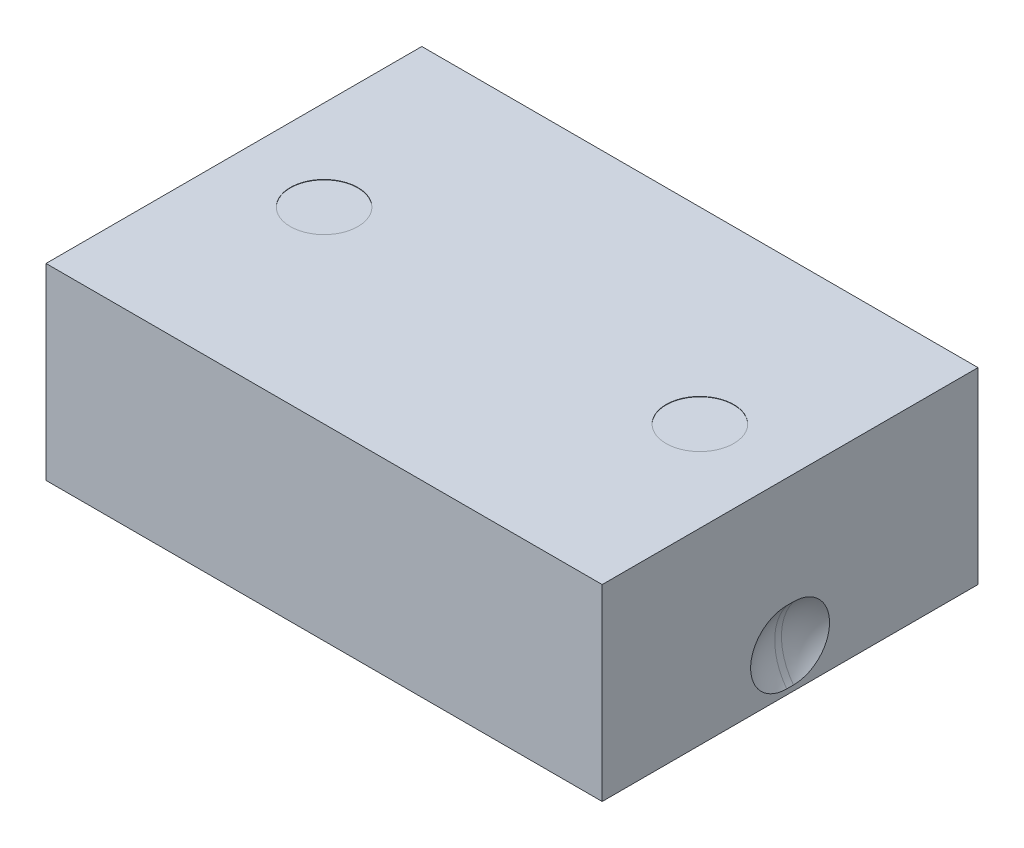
ISO-10303-21;
HEADER;
FILE_DESCRIPTION(('STEP AP214'),'2;1');
FILE_NAME('part.step','',(''),(''),'','','');
FILE_SCHEMA(('AUTOMOTIVE_DESIGN { 1 0 10303 214 1 1 1 1 }'));
ENDSEC;
DATA;
#1=APPLICATION_CONTEXT('core data for automotive mechanical design processes');
#2=APPLICATION_PROTOCOL_DEFINITION('international standard','automotive_design',2000,#1);
#3=PRODUCT_CONTEXT('',#1,'mechanical');
#4=PRODUCT('Part','Part','',(#3));
#5=PRODUCT_RELATED_PRODUCT_CATEGORY('part','',(#4));
#6=PRODUCT_DEFINITION_FORMATION('','',#4);
#7=PRODUCT_DEFINITION_CONTEXT('part definition',#1,'design');
#8=PRODUCT_DEFINITION('design','',#6,#7);
#9=PRODUCT_DEFINITION_SHAPE('','',#8);
#10=(LENGTH_UNIT() NAMED_UNIT(*) SI_UNIT(.MILLI.,.METRE.));
#11=(NAMED_UNIT(*) PLANE_ANGLE_UNIT() SI_UNIT($,.RADIAN.));
#12=(NAMED_UNIT(*) SI_UNIT($,.STERADIAN.) SOLID_ANGLE_UNIT());
#13=UNCERTAINTY_MEASURE_WITH_UNIT(LENGTH_MEASURE(1.E-05),#10,'distance_accuracy_value','');
#14=(GEOMETRIC_REPRESENTATION_CONTEXT(3) GLOBAL_UNCERTAINTY_ASSIGNED_CONTEXT((#13)) GLOBAL_UNIT_ASSIGNED_CONTEXT((#10,
#11,#12)) REPRESENTATION_CONTEXT('',''));
#15=CARTESIAN_POINT('',(0.,0.,0.));
#16=DIRECTION('',(0.,0.,1.));
#17=DIRECTION('',(1.,0.,0.));
#18=AXIS2_PLACEMENT_3D('',#15,#16,#17);
#19=CARTESIAN_POINT('',(50.,120.,0.));
#20=DIRECTION('',(0.,1.,0.));
#21=DIRECTION('',(0.,0.,1.));
#22=AXIS2_PLACEMENT_3D('',#19,#20,#21);
#23=PLANE('',#22);
#24=CARTESIAN_POINT('',(-50.,120.,0.));
#25=DIRECTION('',(0.,1.,0.));
#26=DIRECTION('',(0.,0.,1.));
#27=AXIS2_PLACEMENT_3D('',#24,#25,#26);
#28=CIRCLE('',#27,9.);
#29=CARTESIAN_POINT('',(-50.,120.,9.));
#30=VERTEX_POINT('',#29);
#31=EDGE_CURVE('E326',#30,#30,#28,.T.);
#32=ORIENTED_EDGE('',*,*,#31,.F.);
#33=EDGE_LOOP('',(#32));
#34=FACE_BOUND('',#33,.T.);
#35=CARTESIAN_POINT('',(50.,120.,0.));
#36=DIRECTION('',(0.,1.,0.));
#37=DIRECTION('',(0.,0.,1.));
#38=AXIS2_PLACEMENT_3D('',#35,#36,#37);
#39=CIRCLE('',#38,9.);
#40=CARTESIAN_POINT('',(50.,120.,9.));
#41=VERTEX_POINT('',#40);
#42=EDGE_CURVE('E318',#41,#41,#39,.T.);
#43=ORIENTED_EDGE('',*,*,#42,.F.);
#44=EDGE_LOOP('',(#43));
#45=FACE_BOUND('',#44,.T.);
#46=DIRECTION('',(0.,0.,-1.));
#47=VECTOR('',#46,1.);
#48=CARTESIAN_POINT('',(74.,120.,-50.));
#49=LINE('',#48,#47);
#50=CARTESIAN_POINT('',(74.,120.,-50.));
#51=VERTEX_POINT('',#50);
#52=CARTESIAN_POINT('',(74.,120.,50.));
#53=VERTEX_POINT('',#52);
#54=EDGE_CURVE('E92',#51,#53,#49,.F.);
#55=ORIENTED_EDGE('',*,*,#54,.F.);
#56=DIRECTION('',(-1.,0.,0.));
#57=VECTOR('',#56,1.);
#58=CARTESIAN_POINT('',(-74.,120.,-50.));
#59=LINE('',#58,#57);
#60=CARTESIAN_POINT('',(-74.,120.,-50.));
#61=VERTEX_POINT('',#60);
#62=EDGE_CURVE('E102',#61,#51,#59,.F.);
#63=ORIENTED_EDGE('',*,*,#62,.F.);
#64=DIRECTION('',(0.,0.,1.));
#65=VECTOR('',#64,1.);
#66=CARTESIAN_POINT('',(-74.,120.,50.));
#67=LINE('',#66,#65);
#68=CARTESIAN_POINT('',(-74.,120.,50.));
#69=VERTEX_POINT('',#68);
#70=EDGE_CURVE('E108',#69,#61,#67,.F.);
#71=ORIENTED_EDGE('',*,*,#70,.F.);
#72=DIRECTION('',(1.,0.,0.));
#73=VECTOR('',#72,1.);
#74=CARTESIAN_POINT('',(74.,120.,50.));
#75=LINE('',#74,#73);
#76=EDGE_CURVE('E107',#53,#69,#75,.F.);
#77=ORIENTED_EDGE('',*,*,#76,.F.);
#78=EDGE_LOOP('',(#55,#63,#71,#77));
#79=FACE_BOUND('',#78,.T.);
#80=ADVANCED_FACE('F14',(#34,#45,#79),#23,.T.);
#81=CARTESIAN_POINT('',(50.,115.,0.));
#82=DIRECTION('',(0.,1.,0.));
#83=DIRECTION('',(0.,0.,1.));
#84=AXIS2_PLACEMENT_3D('',#81,#82,#83);
#85=PLANE('',#84);
#86=CARTESIAN_POINT('',(50.,115.,0.));
#87=DIRECTION('',(0.,-1.,0.));
#88=DIRECTION('',(0.,0.,-1.));
#89=AXIS2_PLACEMENT_3D('',#86,#87,#88);
#90=CIRCLE('',#89,9.);
#91=CARTESIAN_POINT('',(50.,115.,-9.));
#92=VERTEX_POINT('',#91);
#93=EDGE_CURVE('E9',#92,#92,#90,.F.);
#94=ORIENTED_EDGE('',*,*,#93,.F.);
#95=EDGE_LOOP('',(#94));
#96=FACE_BOUND('',#95,.T.);
#97=ADVANCED_FACE('F175',(#96),#85,.F.);
#98=CARTESIAN_POINT('',(-50.,115.,0.));
#99=DIRECTION('',(0.,1.,0.));
#100=DIRECTION('',(0.,0.,1.));
#101=AXIS2_PLACEMENT_3D('',#98,#99,#100);
#102=PLANE('',#101);
#103=CARTESIAN_POINT('',(-50.,115.,0.));
#104=DIRECTION('',(0.,1.,0.));
#105=DIRECTION('',(0.,0.,1.));
#106=AXIS2_PLACEMENT_3D('',#103,#104,#105);
#107=CIRCLE('',#106,9.);
#108=CARTESIAN_POINT('',(-50.,115.,9.));
#109=VERTEX_POINT('',#108);
#110=EDGE_CURVE('E23',#109,#109,#107,.T.);
#111=ORIENTED_EDGE('',*,*,#110,.F.);
#112=EDGE_LOOP('',(#111));
#113=FACE_BOUND('',#112,.T.);
#114=ADVANCED_FACE('F172',(#113),#102,.F.);
#115=CARTESIAN_POINT('',(-50.,97.5,0.));
#116=DIRECTION('',(0.,1.,0.));
#117=DIRECTION('',(0.,0.,1.));
#118=AXIS2_PLACEMENT_3D('',#115,#116,#117);
#119=CYLINDRICAL_SURFACE('',#118,9.);
#120=ORIENTED_EDGE('',*,*,#110,.T.);
#121=EDGE_LOOP('',(#120));
#122=FACE_BOUND('',#121,.T.);
#123=CARTESIAN_POINT('',(-50.,80.,0.));
#124=DIRECTION('',(0.,1.,0.));
#125=DIRECTION('',(0.,0.,1.));
#126=AXIS2_PLACEMENT_3D('',#123,#124,#125);
#127=CIRCLE('',#126,9.);
#128=CARTESIAN_POINT('',(-50.,80.,9.));
#129=VERTEX_POINT('',#128);
#130=EDGE_CURVE('E17',#129,#129,#127,.F.);
#131=ORIENTED_EDGE('',*,*,#130,.T.);
#132=EDGE_LOOP('',(#131));
#133=FACE_BOUND('',#132,.T.);
#134=ADVANCED_FACE('F174',(#122,#133),#119,.F.);
#135=CARTESIAN_POINT('',(-57.125,80.,0.));
#136=DIRECTION('',(0.,-1.,0.));
#137=DIRECTION('',(0.,0.,-1.));
#138=AXIS2_PLACEMENT_3D('',#135,#136,#137);
#139=PLANE('',#138);
#140=CARTESIAN_POINT('',(-50.,80.,0.));
#141=DIRECTION('',(0.,1.,0.));
#142=DIRECTION('',(0.,0.,1.));
#143=AXIS2_PLACEMENT_3D('',#140,#141,#142);
#144=CIRCLE('',#143,5.25);
#145=CARTESIAN_POINT('',(-50.,80.,5.25));
#146=VERTEX_POINT('',#145);
#147=EDGE_CURVE('E310',#146,#146,#144,.F.);
#148=ORIENTED_EDGE('',*,*,#147,.T.);
#149=EDGE_LOOP('',(#148));
#150=FACE_BOUND('',#149,.T.);
#151=ORIENTED_EDGE('',*,*,#130,.F.);
#152=EDGE_LOOP('',(#151));
#153=FACE_BOUND('',#152,.T.);
#154=ADVANCED_FACE('F193',(#150,#153),#139,.F.);
#155=CARTESIAN_POINT('',(-50.,72.1,0.));
#156=DIRECTION('',(0.,1.,0.));
#157=DIRECTION('',(0.,0.,1.));
#158=AXIS2_PLACEMENT_3D('',#155,#156,#157);
#159=CYLINDRICAL_SURFACE('',#158,5.25);
#160=ORIENTED_EDGE('',*,*,#147,.F.);
#161=EDGE_LOOP('',(#160));
#162=FACE_BOUND('',#161,.T.);
#163=CARTESIAN_POINT('',(-50.,64.3,0.));
#164=DIRECTION('',(0.,1.,0.));
#165=DIRECTION('',(0.,0.,1.));
#166=AXIS2_PLACEMENT_3D('',#163,#164,#165);
#167=CIRCLE('',#166,5.25);
#168=CARTESIAN_POINT('',(-50.,64.3,5.25));
#169=VERTEX_POINT('',#168);
#170=EDGE_CURVE('E304',#169,#169,#167,.T.);
#171=ORIENTED_EDGE('',*,*,#170,.F.);
#172=EDGE_LOOP('',(#171));
#173=FACE_BOUND('',#172,.T.);
#174=ADVANCED_FACE('F200',(#162,#173),#159,.F.);
#175=CARTESIAN_POINT('',(-54.5,64.3,0.));
#176=DIRECTION('',(0.,-1.,0.));
#177=DIRECTION('',(0.,0.,-1.));
#178=AXIS2_PLACEMENT_3D('',#175,#176,#177);
#179=PLANE('',#178);
#180=CARTESIAN_POINT('',(-50.,64.3,0.));
#181=DIRECTION('',(0.,1.,0.));
#182=DIRECTION('',(0.,0.,1.));
#183=AXIS2_PLACEMENT_3D('',#180,#181,#182);
#184=CIRCLE('',#183,9.);
#185=CARTESIAN_POINT('',(-50.,64.3,9.));
#186=VERTEX_POINT('',#185);
#187=EDGE_CURVE('E292',#186,#186,#184,.T.);
#188=ORIENTED_EDGE('',*,*,#187,.F.);
#189=EDGE_LOOP('',(#188));
#190=FACE_BOUND('',#189,.T.);
#191=ORIENTED_EDGE('',*,*,#170,.T.);
#192=EDGE_LOOP('',(#191));
#193=FACE_BOUND('',#192,.T.);
#194=ADVANCED_FACE('F221',(#190,#193),#179,.T.);
#195=CARTESIAN_POINT('',(-50.,67.15,0.));
#196=DIRECTION('',(0.,1.,0.));
#197=DIRECTION('',(0.,0.,1.));
#198=AXIS2_PLACEMENT_3D('',#195,#196,#197);
#199=CYLINDRICAL_SURFACE('',#198,9.);
#200=ORIENTED_EDGE('',*,*,#187,.T.);
#201=EDGE_LOOP('',(#200));
#202=FACE_BOUND('',#201,.T.);
#203=CARTESIAN_POINT('',(-50.,70.,0.));
#204=DIRECTION('',(0.,1.,0.));
#205=DIRECTION('',(0.,0.,1.));
#206=AXIS2_PLACEMENT_3D('',#203,#204,#205);
#207=CIRCLE('',#206,9.);
#208=CARTESIAN_POINT('',(-50.,70.,9.));
#209=VERTEX_POINT('',#208);
#210=EDGE_CURVE('E120',#209,#209,#207,.F.);
#211=ORIENTED_EDGE('',*,*,#210,.T.);
#212=EDGE_LOOP('',(#211));
#213=FACE_BOUND('',#212,.T.);
#214=ADVANCED_FACE('F229',(#202,#213),#199,.T.);
#215=CARTESIAN_POINT('',(50.,67.15,0.));
#216=DIRECTION('',(0.,-1.,0.));
#217=DIRECTION('',(0.,0.,-1.));
#218=AXIS2_PLACEMENT_3D('',#215,#216,#217);
#219=CYLINDRICAL_SURFACE('',#218,9.);
#220=CARTESIAN_POINT('',(50.,64.3,0.));
#221=DIRECTION('',(0.,-1.,0.));
#222=DIRECTION('',(0.,0.,-1.));
#223=AXIS2_PLACEMENT_3D('',#220,#221,#222);
#224=CIRCLE('',#223,9.);
#225=CARTESIAN_POINT('',(50.,64.3,-9.));
#226=VERTEX_POINT('',#225);
#227=EDGE_CURVE('E98',#226,#226,#224,.F.);
#228=ORIENTED_EDGE('',*,*,#227,.T.);
#229=EDGE_LOOP('',(#228));
#230=FACE_BOUND('',#229,.T.);
#231=CARTESIAN_POINT('',(50.,70.,0.));
#232=DIRECTION('',(0.,-1.,0.));
#233=DIRECTION('',(0.,0.,-1.));
#234=AXIS2_PLACEMENT_3D('',#231,#232,#233);
#235=CIRCLE('',#234,9.);
#236=CARTESIAN_POINT('',(50.,70.,-9.));
#237=VERTEX_POINT('',#236);
#238=EDGE_CURVE('E134',#237,#237,#235,.T.);
#239=ORIENTED_EDGE('',*,*,#238,.T.);
#240=EDGE_LOOP('',(#239));
#241=FACE_BOUND('',#240,.T.);
#242=ADVANCED_FACE('F267',(#230,#241),#219,.T.);
#243=CARTESIAN_POINT('',(-86.8,81.,-0.900000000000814));
#244=DIRECTION('',(0.411996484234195,0.570250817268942,0.710684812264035));
#245=DIRECTION('',(-0.809037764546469,0.587750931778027,-0.00259571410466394));
#246=AXIS2_PLACEMENT_3D('',#243,#244,#245);
#247=SPHERICAL_SURFACE('',#246,16.);
#248=CARTESIAN_POINT('',(-86.8,81.,-0.9));
#249=DIRECTION('',(0.,0.,1.));
#250=DIRECTION('',(1.,0.,0.));
#251=AXIS2_PLACEMENT_3D('',#248,#249,#250);
#252=CIRCLE('',#251,16.);
#253=CARTESIAN_POINT('',(-74.,71.4,-0.9));
#254=VERTEX_POINT('',#253);
#255=CARTESIAN_POINT('',(-74.,90.6,-0.9));
#256=VERTEX_POINT('',#255);
#257=EDGE_CURVE('E293',#254,#256,#252,.T.);
#258=ORIENTED_EDGE('',*,*,#257,.T.);
#259=CARTESIAN_POINT('',(-74.,71.3999999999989,-0.9));
#260=CARTESIAN_POINT('',(-74.,71.3999709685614,-1.17000302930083));
#261=CARTESIAN_POINT('',(-74.,71.411389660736,-1.44000188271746));
#262=CARTESIAN_POINT('',(-74.,71.4569128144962,-1.97806793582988));
#263=CARTESIAN_POINT('',(-74.,71.4910161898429,-2.24613522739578));
#264=CARTESIAN_POINT('',(-74.,71.5816671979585,-2.77825399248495));
#265=CARTESIAN_POINT('',(-74.,71.6381990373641,-3.04230815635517));
#266=CARTESIAN_POINT('',(-74.,71.7732956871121,-3.56471500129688));
#267=CARTESIAN_POINT('',(-74.,71.8518602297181,-3.82306775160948));
#268=CARTESIAN_POINT('',(-74.,72.0305080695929,-4.33235682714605));
#269=CARTESIAN_POINT('',(-74.,72.1306012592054,-4.5832896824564));
#270=CARTESIAN_POINT('',(-74.,72.3515750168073,-5.07583571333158));
#271=CARTESIAN_POINT('',(-74.,72.4724560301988,-5.31744868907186));
#272=CARTESIAN_POINT('',(-74.,72.7341176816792,-5.7895827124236));
#273=CARTESIAN_POINT('',(-74.,72.8748942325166,-6.02010602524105));
#274=CARTESIAN_POINT('',(-74.,73.1753642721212,-6.46847415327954));
#275=CARTESIAN_POINT('',(-74.,73.3350576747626,-6.68631902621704));
#276=CARTESIAN_POINT('',(-74.,73.6722327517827,-7.10779034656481));
#277=CARTESIAN_POINT('',(-74.,73.8497150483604,-7.31141629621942));
#278=CARTESIAN_POINT('',(-74.,74.2211976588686,-7.70298975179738));
#279=CARTESIAN_POINT('',(-74.,74.4151976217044,-7.89093759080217));
#280=CARTESIAN_POINT('',(-74.,74.8183728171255,-8.24985305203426));
#281=CARTESIAN_POINT('',(-74.,75.0275505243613,-8.42081789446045));
#282=CARTESIAN_POINT('',(-74.,75.45956572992,-8.74451672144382));
#283=CARTESIAN_POINT('',(-74.,75.682403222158,-8.89725071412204));
#284=CARTESIAN_POINT('',(-74.,76.1401435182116,-9.18339562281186));
#285=CARTESIAN_POINT('',(-74.,76.3750457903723,-9.31680738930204));
#286=CARTESIAN_POINT('',(-74.,76.8552545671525,-9.56336732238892));
#287=CARTESIAN_POINT('',(-74.,77.1005610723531,-9.67651548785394));
#288=CARTESIAN_POINT('',(-74.,77.5998181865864,-9.88173715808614));
#289=CARTESIAN_POINT('',(-74.,77.853768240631,-9.97381201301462));
#290=CARTESIAN_POINT('',(-74.,78.3685220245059,-10.1362417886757));
#291=CARTESIAN_POINT('',(-74.,78.6293257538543,-10.2065967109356));
#292=CARTESIAN_POINT('',(-74.,79.1559382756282,-10.3250876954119));
#293=CARTESIAN_POINT('',(-74.,79.421747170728,-10.3732233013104));
#294=CARTESIAN_POINT('',(-74.,79.9564751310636,-10.446931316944));
#295=CARTESIAN_POINT('',(-74.,80.2253941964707,-10.4725037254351));
#296=CARTESIAN_POINT('',(-74.,80.7644368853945,-10.5009038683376));
#297=CARTESIAN_POINT('',(-74.,81.0345605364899,-10.5037310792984));
#298=CARTESIAN_POINT('',(-74.,81.57408578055,-10.4866193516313));
#299=CARTESIAN_POINT('',(-74.,81.843487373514,-10.4666804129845));
#300=CARTESIAN_POINT('',(-74.,82.3796505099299,-10.4041784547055));
#301=CARTESIAN_POINT('',(-74.,82.6464120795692,-10.3616156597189));
#302=CARTESIAN_POINT('',(-74.,83.1754013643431,-10.254168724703));
#303=CARTESIAN_POINT('',(-74.,83.4376290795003,-10.1892845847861));
#304=CARTESIAN_POINT('',(-74.,83.9556855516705,-10.0376564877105));
#305=CARTESIAN_POINT('',(-74.,84.2115143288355,-9.95091259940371));
#306=CARTESIAN_POINT('',(-74.,84.7149549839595,-9.75618160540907));
#307=CARTESIAN_POINT('',(-74.,84.9625668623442,-9.64819450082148));
#308=CARTESIAN_POINT('',(-74.,85.4478197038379,-9.41174170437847));
#309=CARTESIAN_POINT('',(-74.,85.6854604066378,-9.28327547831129));
#310=CARTESIAN_POINT('',(-74.,86.1490745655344,-9.0067797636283));
#311=CARTESIAN_POINT('',(-74.,86.3750480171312,-8.85875026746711));
#312=CARTESIAN_POINT('',(-74.,86.8137102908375,-8.5441881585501));
#313=CARTESIAN_POINT('',(-74.,87.0263997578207,-8.37765644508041));
#314=CARTESIAN_POINT('',(-74.,87.4369936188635,-8.02726825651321));
#315=CARTESIAN_POINT('',(-74.,87.6348980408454,-7.84341181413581));
#316=CARTESIAN_POINT('',(-74.,88.0144879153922,-7.45970867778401));
#317=CARTESIAN_POINT('',(-74.,88.1961757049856,-7.25986429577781));
#318=CARTESIAN_POINT('',(-74.,88.5420768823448,-6.84557802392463));
#319=CARTESIAN_POINT('',(-74.,88.7062898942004,-6.63113582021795));
#320=CARTESIAN_POINT('',(-74.,89.0161199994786,-6.18911041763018));
#321=CARTESIAN_POINT('',(-74.,89.1617310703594,-5.96152299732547));
#322=CARTESIAN_POINT('',(-74.,89.4332554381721,-5.49489573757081));
#323=CARTESIAN_POINT('',(-74.,89.5591693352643,-5.25585624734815));
#324=CARTESIAN_POINT('',(-74.,89.7904830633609,-4.76786320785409));
#325=CARTESIAN_POINT('',(-74.,89.8958697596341,-4.51890343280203));
#326=CARTESIAN_POINT('',(-74.,90.0852761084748,-4.01299030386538));
#327=CARTESIAN_POINT('',(-74.,90.1692963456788,-3.75603716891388));
#328=CARTESIAN_POINT('',(-74.,90.315281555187,-3.23630141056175));
#329=CARTESIAN_POINT('',(-74.,90.377274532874,-2.97352664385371));
#330=CARTESIAN_POINT('',(-74.,90.4788912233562,-2.44379460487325));
#331=CARTESIAN_POINT('',(-74.,90.518525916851,-2.17683945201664));
#332=CARTESIAN_POINT('',(-74.,90.5645706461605,-1.74108609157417));
#333=CARTESIAN_POINT('',(-74.,90.5778651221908,-1.57298540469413));
#334=CARTESIAN_POINT('',(-74.,90.59557343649,-1.236595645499));
#335=CARTESIAN_POINT('',(-74.,90.6000019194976,-1.06830734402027));
#336=CARTESIAN_POINT('',(-74.,90.6000000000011,-0.9));
#337=B_SPLINE_CURVE_WITH_KNOTS('',3,(#259,#260,#261,#262,#263,#264,#265,#266,#267,#268,#269,
#270,#271,#272,#273,#274,#275,#276,#277,#278,#279,#280,#281,#282,#283,#284,#285,#286,#287,#288,
#289,#290,#291,#292,#293,#294,#295,#296,#297,#298,#299,#300,#301,#302,#303,#304,#305,#306,#307,
#308,#309,#310,#311,#312,#313,#314,#315,#316,#317,#318,#319,#320,#321,#322,#323,#324,#325,#326,
#327,#328,#329,#330,#331,#332,#333,#334,#335,#336),.UNSPECIFIED.,.F.,.F.,(4,2,2,2,2,2,2,2,2,2,2,
2,2,2,2,2,2,2,2,2,2,2,2,2,2,2,2,2,2,2,2,2,2,2,2,2,2,2,4),(0.,0.809761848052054,1.61948492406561,
2.42863882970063,3.23778290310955,4.04729957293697,4.85683358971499,5.66620154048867,
6.47556580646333,7.2849583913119,8.09433377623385,8.90384142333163,9.7133487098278,
10.5228203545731,11.3322920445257,12.1417118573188,12.9511316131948,13.760567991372,
14.5700044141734,15.3794594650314,16.1889145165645,16.998361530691,17.8078085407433,
18.6172530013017,19.4266974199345,20.2361629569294,21.0456288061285,21.8550553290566,
22.6644803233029,23.4737884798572,24.2831140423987,25.0927009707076,25.9022632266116,
26.7123418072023,27.522398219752,28.3314210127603,29.1400461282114,29.6457079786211,
30.1505338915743),.UNSPECIFIED.);
#338=EDGE_CURVE('E114',#254,#256,#337,.T.);
#339=ORIENTED_EDGE('',*,*,#338,.F.);
#340=EDGE_LOOP('',(#258,#339));
#341=FACE_BOUND('',#340,.T.);
#342=ADVANCED_FACE('F252',(#341),#247,.F.);
#343=CARTESIAN_POINT('',(-86.8,81.,0.900000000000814));
#344=DIRECTION('',(0.411996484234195,0.570250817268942,0.710684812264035));
#345=DIRECTION('',(-0.809037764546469,0.587750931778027,-0.00259571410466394));
#346=AXIS2_PLACEMENT_3D('',#343,#344,#345);
#347=SPHERICAL_SURFACE('',#346,16.);
#348=CARTESIAN_POINT('',(-86.8,81.,0.9));
#349=DIRECTION('',(0.,0.,1.));
#350=DIRECTION('',(1.,0.,0.));
#351=AXIS2_PLACEMENT_3D('',#348,#349,#350);
#352=CIRCLE('',#351,16.);
#353=CARTESIAN_POINT('',(-74.,71.4,0.9));
#354=VERTEX_POINT('',#353);
#355=CARTESIAN_POINT('',(-74.,90.6,0.9));
#356=VERTEX_POINT('',#355);
#357=EDGE_CURVE('E289',#354,#356,#352,.T.);
#358=ORIENTED_EDGE('',*,*,#357,.F.);
#359=CARTESIAN_POINT('',(-74.,90.6000000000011,0.9));
#360=CARTESIAN_POINT('',(-74.,90.6000290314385,1.17000302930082));
#361=CARTESIAN_POINT('',(-74.,90.5886103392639,1.44000188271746));
#362=CARTESIAN_POINT('',(-74.,90.5430871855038,1.97806793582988));
#363=CARTESIAN_POINT('',(-74.,90.5089838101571,2.24613522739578));
#364=CARTESIAN_POINT('',(-74.,90.4183328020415,2.77825399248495));
#365=CARTESIAN_POINT('',(-74.,90.3618009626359,3.04230815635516));
#366=CARTESIAN_POINT('',(-74.,90.226704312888,3.56471500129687));
#367=CARTESIAN_POINT('',(-74.,90.148139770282,3.82306775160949));
#368=CARTESIAN_POINT('',(-74.,89.9694919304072,4.33235682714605));
#369=CARTESIAN_POINT('',(-74.,89.8693987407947,4.58328968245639));
#370=CARTESIAN_POINT('',(-74.,89.6484249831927,5.07583571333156));
#371=CARTESIAN_POINT('',(-74.,89.5275439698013,5.31744868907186));
#372=CARTESIAN_POINT('',(-74.,89.2658823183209,5.78958271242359));
#373=CARTESIAN_POINT('',(-74.,89.1251057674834,6.02010602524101));
#374=CARTESIAN_POINT('',(-74.,88.8246357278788,6.4684741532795));
#375=CARTESIAN_POINT('',(-74.,88.6649423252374,6.68631902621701));
#376=CARTESIAN_POINT('',(-74.,88.3277672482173,7.1077903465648));
#377=CARTESIAN_POINT('',(-74.,88.1502849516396,7.3114162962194));
#378=CARTESIAN_POINT('',(-74.,87.7788023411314,7.70298975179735));
#379=CARTESIAN_POINT('',(-74.,87.5848023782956,7.89093759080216));
#380=CARTESIAN_POINT('',(-74.,87.1816271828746,8.24985305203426));
#381=CARTESIAN_POINT('',(-74.,86.9724494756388,8.42081789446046));
#382=CARTESIAN_POINT('',(-74.,86.54043427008,8.74451672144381));
#383=CARTESIAN_POINT('',(-74.,86.317596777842,8.89725071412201));
#384=CARTESIAN_POINT('',(-74.,85.8598564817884,9.18339562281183));
#385=CARTESIAN_POINT('',(-74.,85.6249542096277,9.31680738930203));
#386=CARTESIAN_POINT('',(-74.,85.1447454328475,9.56336732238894));
#387=CARTESIAN_POINT('',(-74.,84.8994389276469,9.67651548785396));
#388=CARTESIAN_POINT('',(-74.,84.4001818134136,9.88173715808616));
#389=CARTESIAN_POINT('',(-74.,84.146231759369,9.97381201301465));
#390=CARTESIAN_POINT('',(-74.,83.6314779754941,10.1362417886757));
#391=CARTESIAN_POINT('',(-74.,83.3706742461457,10.2065967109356));
#392=CARTESIAN_POINT('',(-74.,82.8440617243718,10.3250876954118));
#393=CARTESIAN_POINT('',(-74.,82.5782528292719,10.3732233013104));
#394=CARTESIAN_POINT('',(-74.,82.0435248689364,10.446931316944));
#395=CARTESIAN_POINT('',(-74.,81.7746058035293,10.4725037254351));
#396=CARTESIAN_POINT('',(-74.,81.2355631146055,10.5009038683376));
#397=CARTESIAN_POINT('',(-74.,80.9654394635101,10.5037310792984));
#398=CARTESIAN_POINT('',(-74.,80.42591421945,10.4866193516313));
#399=CARTESIAN_POINT('',(-74.,80.156512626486,10.4666804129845));
#400=CARTESIAN_POINT('',(-74.,79.6203494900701,10.4041784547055));
#401=CARTESIAN_POINT('',(-74.,79.3535879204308,10.3616156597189));
#402=CARTESIAN_POINT('',(-74.,78.8245986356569,10.254168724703));
#403=CARTESIAN_POINT('',(-74.,78.5623709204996,10.1892845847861));
#404=CARTESIAN_POINT('',(-74.,78.0443144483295,10.0376564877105));
#405=CARTESIAN_POINT('',(-74.,77.7884856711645,9.95091259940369));
#406=CARTESIAN_POINT('',(-74.,77.2850450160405,9.75618160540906));
#407=CARTESIAN_POINT('',(-74.,77.0374331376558,9.64819450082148));
#408=CARTESIAN_POINT('',(-74.,76.5521802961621,9.41174170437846));
#409=CARTESIAN_POINT('',(-74.,76.3145395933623,9.28327547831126));
#410=CARTESIAN_POINT('',(-74.,75.8509254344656,9.00677976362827));
#411=CARTESIAN_POINT('',(-74.,75.6249519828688,8.8587502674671));
#412=CARTESIAN_POINT('',(-74.,75.1862897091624,8.54418815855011));
#413=CARTESIAN_POINT('',(-74.,74.9736002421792,8.37765644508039));
#414=CARTESIAN_POINT('',(-74.,74.5630063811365,8.02726825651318));
#415=CARTESIAN_POINT('',(-74.,74.3651019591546,7.84341181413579));
#416=CARTESIAN_POINT('',(-74.,73.9855120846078,7.45970867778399));
#417=CARTESIAN_POINT('',(-74.,73.8038242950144,7.25986429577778));
#418=CARTESIAN_POINT('',(-74.,73.4579231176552,6.8455780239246));
#419=CARTESIAN_POINT('',(-74.,73.2937101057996,6.63113582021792));
#420=CARTESIAN_POINT('',(-74.,72.9838800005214,6.18911041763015));
#421=CARTESIAN_POINT('',(-74.,72.8382689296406,5.96152299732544));
#422=CARTESIAN_POINT('',(-74.,72.5667445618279,5.49489573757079));
#423=CARTESIAN_POINT('',(-74.,72.4408306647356,5.25585624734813));
#424=CARTESIAN_POINT('',(-74.,72.2095169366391,4.76786320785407));
#425=CARTESIAN_POINT('',(-74.,72.1041302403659,4.518903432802));
#426=CARTESIAN_POINT('',(-74.,71.9147238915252,4.01299030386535));
#427=CARTESIAN_POINT('',(-74.,71.8307036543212,3.75603716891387));
#428=CARTESIAN_POINT('',(-74.,71.684718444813,3.23630141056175));
#429=CARTESIAN_POINT('',(-74.,71.622725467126,2.9735266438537));
#430=CARTESIAN_POINT('',(-74.,71.5211087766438,2.44379460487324));
#431=CARTESIAN_POINT('',(-74.,71.481474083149,2.17683945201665));
#432=CARTESIAN_POINT('',(-74.,71.4354293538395,1.74108609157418));
#433=CARTESIAN_POINT('',(-74.,71.4221348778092,1.57298540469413));
#434=CARTESIAN_POINT('',(-74.,71.40442656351,1.236595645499));
#435=CARTESIAN_POINT('',(-74.,71.3999980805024,1.06830734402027));
#436=CARTESIAN_POINT('',(-74.,71.3999999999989,0.9));
#437=B_SPLINE_CURVE_WITH_KNOTS('',3,(#359,#360,#361,#362,#363,#364,#365,#366,#367,#368,#369,
#370,#371,#372,#373,#374,#375,#376,#377,#378,#379,#380,#381,#382,#383,#384,#385,#386,#387,#388,
#389,#390,#391,#392,#393,#394,#395,#396,#397,#398,#399,#400,#401,#402,#403,#404,#405,#406,#407,
#408,#409,#410,#411,#412,#413,#414,#415,#416,#417,#418,#419,#420,#421,#422,#423,#424,#425,#426,
#427,#428,#429,#430,#431,#432,#433,#434,#435,#436),.UNSPECIFIED.,.F.,.F.,(4,2,2,2,2,2,2,2,2,2,2,
2,2,2,2,2,2,2,2,2,2,2,2,2,2,2,2,2,2,2,2,2,2,2,2,2,2,2,4),(0.,0.80976184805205,1.61948492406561,
2.42863882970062,3.23778290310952,4.04729957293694,4.85683358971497,5.66620154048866,
6.47556580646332,7.28495839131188,8.09433377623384,8.90384142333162,9.71334870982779,
10.5228203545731,11.3322920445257,12.1417118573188,12.9511316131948,13.760567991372,
14.5700044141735,15.3794594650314,16.1889145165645,16.998361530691,17.8078085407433,
18.6172530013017,19.4266974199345,20.2361629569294,21.0456288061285,21.8550553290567,
22.6644803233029,23.4737884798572,24.2831140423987,25.0927009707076,25.9022632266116,
26.7123418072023,27.522398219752,28.3314210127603,29.1400461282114,29.6457079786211,
30.1505338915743),.UNSPECIFIED.);
#438=EDGE_CURVE('E111',#356,#354,#437,.T.);
#439=ORIENTED_EDGE('',*,*,#438,.F.);
#440=EDGE_LOOP('',(#358,#439));
#441=FACE_BOUND('',#440,.T.);
#442=ADVANCED_FACE('F152',(#441),#347,.F.);
#443=CARTESIAN_POINT('',(-86.8,81.,0.));
#444=DIRECTION('',(0.,0.,1.));
#445=DIRECTION('',(1.,0.,0.));
#446=AXIS2_PLACEMENT_3D('',#443,#444,#445);
#447=CYLINDRICAL_SURFACE('',#446,16.);
#448=ORIENTED_EDGE('',*,*,#257,.F.);
#449=DIRECTION('',(0.,0.,1.));
#450=VECTOR('',#449,1.);
#451=CARTESIAN_POINT('',(-74.,71.4,50.));
#452=LINE('',#451,#450);
#453=EDGE_CURVE('E101',#354,#254,#452,.F.);
#454=ORIENTED_EDGE('',*,*,#453,.F.);
#455=ORIENTED_EDGE('',*,*,#357,.T.);
#456=DIRECTION('',(0.,0.,1.));
#457=VECTOR('',#456,1.);
#458=CARTESIAN_POINT('',(-74.,90.6,50.));
#459=LINE('',#458,#457);
#460=EDGE_CURVE('E112',#256,#356,#459,.T.);
#461=ORIENTED_EDGE('',*,*,#460,.F.);
#462=EDGE_LOOP('',(#448,#454,#455,#461));
#463=FACE_BOUND('',#462,.T.);
#464=ADVANCED_FACE('F239',(#463),#447,.F.);
#465=CARTESIAN_POINT('',(86.8,81.,0.900000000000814));
#466=DIRECTION('',(0.411996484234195,0.570250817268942,0.710684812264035));
#467=DIRECTION('',(-0.809037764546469,0.587750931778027,-0.00259571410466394));
#468=AXIS2_PLACEMENT_3D('',#465,#466,#467);
#469=SPHERICAL_SURFACE('',#468,16.);
#470=CARTESIAN_POINT('',(86.8,81.,0.9));
#471=DIRECTION('',(0.,0.,-1.));
#472=DIRECTION('',(-1.,0.,0.));
#473=AXIS2_PLACEMENT_3D('',#470,#471,#472);
#474=CIRCLE('',#473,16.);
#475=CARTESIAN_POINT('',(74.,71.4,0.9));
#476=VERTEX_POINT('',#475);
#477=CARTESIAN_POINT('',(74.,90.6,0.89999999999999));
#478=VERTEX_POINT('',#477);
#479=EDGE_CURVE('E71',#476,#478,#474,.T.);
#480=ORIENTED_EDGE('',*,*,#479,.T.);
#481=CARTESIAN_POINT('',(74.,71.3999999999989,0.9));
#482=CARTESIAN_POINT('',(74.,71.3999709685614,1.17000302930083));
#483=CARTESIAN_POINT('',(74.,71.411389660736,1.44000188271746));
#484=CARTESIAN_POINT('',(74.,71.4569128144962,1.97806793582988));
#485=CARTESIAN_POINT('',(74.,71.4910161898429,2.24613522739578));
#486=CARTESIAN_POINT('',(74.,71.5816671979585,2.77825399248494));
#487=CARTESIAN_POINT('',(74.,71.6381990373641,3.04230815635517));
#488=CARTESIAN_POINT('',(74.,71.7732956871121,3.56471500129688));
#489=CARTESIAN_POINT('',(74.,71.8518602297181,3.82306775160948));
#490=CARTESIAN_POINT('',(74.,72.0305080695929,4.33235682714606));
#491=CARTESIAN_POINT('',(74.,72.1306012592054,4.58328968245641));
#492=CARTESIAN_POINT('',(74.,72.3515750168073,5.07583571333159));
#493=CARTESIAN_POINT('',(74.,72.4724560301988,5.31744868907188));
#494=CARTESIAN_POINT('',(74.,72.7341176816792,5.78958271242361));
#495=CARTESIAN_POINT('',(74.,72.8748942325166,6.02010602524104));
#496=CARTESIAN_POINT('',(74.,73.1753642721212,6.46847415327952));
#497=CARTESIAN_POINT('',(74.,73.3350576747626,6.68631902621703));
#498=CARTESIAN_POINT('',(74.,73.6722327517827,7.10779034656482));
#499=CARTESIAN_POINT('',(74.,73.8497150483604,7.31141629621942));
#500=CARTESIAN_POINT('',(74.,74.2211976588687,7.70298975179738));
#501=CARTESIAN_POINT('',(74.,74.4151976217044,7.89093759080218));
#502=CARTESIAN_POINT('',(74.,74.8183728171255,8.2498530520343));
#503=CARTESIAN_POINT('',(74.,75.0275505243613,8.42081789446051));
#504=CARTESIAN_POINT('',(74.,75.4595657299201,8.74451672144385));
#505=CARTESIAN_POINT('',(74.,75.6824032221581,8.89725071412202));
#506=CARTESIAN_POINT('',(74.,76.1401435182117,9.18339562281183));
#507=CARTESIAN_POINT('',(74.,76.3750457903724,9.31680738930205));
#508=CARTESIAN_POINT('',(74.,76.8552545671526,9.56336732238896));
#509=CARTESIAN_POINT('',(74.,77.1005610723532,9.67651548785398));
#510=CARTESIAN_POINT('',(74.,77.5998181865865,9.88173715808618));
#511=CARTESIAN_POINT('',(74.,77.8537682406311,9.97381201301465));
#512=CARTESIAN_POINT('',(74.,78.368522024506,10.1362417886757));
#513=CARTESIAN_POINT('',(74.,78.6293257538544,10.2065967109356));
#514=CARTESIAN_POINT('',(74.,79.1559382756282,10.3250876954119));
#515=CARTESIAN_POINT('',(74.,79.4217471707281,10.3732233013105));
#516=CARTESIAN_POINT('',(74.,79.9564751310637,10.446931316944));
#517=CARTESIAN_POINT('',(74.,80.2253941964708,10.4725037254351));
#518=CARTESIAN_POINT('',(74.,80.7644368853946,10.5009038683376));
#519=CARTESIAN_POINT('',(74.,81.03456053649,10.5037310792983));
#520=CARTESIAN_POINT('',(74.,81.5740857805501,10.4866193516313));
#521=CARTESIAN_POINT('',(74.,81.8434873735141,10.4666804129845));
#522=CARTESIAN_POINT('',(74.,82.37965050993,10.4041784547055));
#523=CARTESIAN_POINT('',(74.,82.6464120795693,10.3616156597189));
#524=CARTESIAN_POINT('',(74.,83.1754013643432,10.254168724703));
#525=CARTESIAN_POINT('',(74.,83.4376290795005,10.189284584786));
#526=CARTESIAN_POINT('',(74.,83.9556855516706,10.0376564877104));
#527=CARTESIAN_POINT('',(74.,84.2115143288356,9.95091259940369));
#528=CARTESIAN_POINT('',(74.,84.7149549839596,9.75618160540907));
#529=CARTESIAN_POINT('',(74.,84.9625668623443,9.64819450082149));
#530=CARTESIAN_POINT('',(74.,85.447819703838,9.41174170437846));
#531=CARTESIAN_POINT('',(74.,85.6854604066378,9.28327547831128));
#532=CARTESIAN_POINT('',(74.,86.1490745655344,9.00677976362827));
#533=CARTESIAN_POINT('',(74.,86.3750480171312,8.85875026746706));
#534=CARTESIAN_POINT('',(74.,86.8137102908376,8.54418815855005));
#535=CARTESIAN_POINT('',(74.,87.0263997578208,8.37765644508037));
#536=CARTESIAN_POINT('',(74.,87.4369936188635,8.02726825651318));
#537=CARTESIAN_POINT('',(74.,87.6348980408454,7.84341181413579));
#538=CARTESIAN_POINT('',(74.,88.0144879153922,7.45970867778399));
#539=CARTESIAN_POINT('',(74.,88.1961757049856,7.25986429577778));
#540=CARTESIAN_POINT('',(74.,88.5420768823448,6.8455780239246));
#541=CARTESIAN_POINT('',(74.,88.7062898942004,6.63113582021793));
#542=CARTESIAN_POINT('',(74.,89.0161199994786,6.18911041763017));
#543=CARTESIAN_POINT('',(74.,89.1617310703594,5.96152299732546));
#544=CARTESIAN_POINT('',(74.,89.4332554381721,5.4948957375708));
#545=CARTESIAN_POINT('',(74.,89.5591693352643,5.25585624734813));
#546=CARTESIAN_POINT('',(74.,89.7904830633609,4.76786320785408));
#547=CARTESIAN_POINT('',(74.,89.8958697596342,4.51890343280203));
#548=CARTESIAN_POINT('',(74.,90.0852761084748,4.01299030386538));
#549=CARTESIAN_POINT('',(74.,90.1692963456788,3.75603716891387));
#550=CARTESIAN_POINT('',(74.,90.315281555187,3.23630141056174));
#551=CARTESIAN_POINT('',(74.,90.377274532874,2.9735266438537));
#552=CARTESIAN_POINT('',(74.,90.4788912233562,2.44379460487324));
#553=CARTESIAN_POINT('',(74.,90.518525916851,2.17683945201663));
#554=CARTESIAN_POINT('',(74.,90.5645706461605,1.74108609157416));
#555=CARTESIAN_POINT('',(74.,90.5778651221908,1.57298540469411));
#556=CARTESIAN_POINT('',(74.,90.5955734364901,1.23659564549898));
#557=CARTESIAN_POINT('',(74.,90.6000019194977,1.06830734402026));
#558=CARTESIAN_POINT('',(74.,90.6000000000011,0.899999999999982));
#559=B_SPLINE_CURVE_WITH_KNOTS('',3,(#481,#482,#483,#484,#485,#486,#487,#488,#489,#490,#491,
#492,#493,#494,#495,#496,#497,#498,#499,#500,#501,#502,#503,#504,#505,#506,#507,#508,#509,#510,
#511,#512,#513,#514,#515,#516,#517,#518,#519,#520,#521,#522,#523,#524,#525,#526,#527,#528,#529,
#530,#531,#532,#533,#534,#535,#536,#537,#538,#539,#540,#541,#542,#543,#544,#545,#546,#547,#548,
#549,#550,#551,#552,#553,#554,#555,#556,#557,#558),.UNSPECIFIED.,.F.,.F.,(4,2,2,2,2,2,2,2,2,2,2,
2,2,2,2,2,2,2,2,2,2,2,2,2,2,2,2,2,2,2,2,2,2,2,2,2,2,2,4),(0.,0.809761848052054,1.61948492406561,
2.42863882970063,3.23778290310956,4.04729957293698,4.856833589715,5.66620154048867,
6.47556580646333,7.28495839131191,8.09433377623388,8.90384142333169,9.71334870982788,
10.5228203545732,11.3322920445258,12.1417118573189,12.9511316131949,13.7605679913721,
14.5700044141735,15.3794594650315,16.1889145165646,16.9983615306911,17.8078085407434,
18.6172530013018,19.4266974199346,20.2361629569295,21.0456288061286,21.8550553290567,
22.6644803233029,23.4737884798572,24.2831140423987,25.0927009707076,25.9022632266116,
26.7123418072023,27.522398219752,28.3314210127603,29.1400461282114,29.6457079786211,
30.1505338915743),.UNSPECIFIED.);
#560=EDGE_CURVE('E76',#476,#478,#559,.T.);
#561=ORIENTED_EDGE('',*,*,#560,.F.);
#562=EDGE_LOOP('',(#480,#561));
#563=FACE_BOUND('',#562,.T.);
#564=ADVANCED_FACE('F84',(#563),#469,.F.);
#565=CARTESIAN_POINT('',(86.8,81.,-0.900000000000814));
#566=DIRECTION('',(0.411996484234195,0.570250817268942,0.710684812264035));
#567=DIRECTION('',(-0.809037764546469,0.587750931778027,-0.00259571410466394));
#568=AXIS2_PLACEMENT_3D('',#565,#566,#567);
#569=SPHERICAL_SURFACE('',#568,16.);
#570=CARTESIAN_POINT('',(86.8,81.,-0.9));
#571=DIRECTION('',(0.,0.,-1.));
#572=DIRECTION('',(-1.,0.,0.));
#573=AXIS2_PLACEMENT_3D('',#570,#571,#572);
#574=CIRCLE('',#573,16.);
#575=CARTESIAN_POINT('',(74.,71.4,-0.9));
#576=VERTEX_POINT('',#575);
#577=CARTESIAN_POINT('',(74.,90.6,-0.9));
#578=VERTEX_POINT('',#577);
#579=EDGE_CURVE('E85',#576,#578,#574,.T.);
#580=ORIENTED_EDGE('',*,*,#579,.F.);
#581=CARTESIAN_POINT('',(74.,90.6000000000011,-0.9));
#582=CARTESIAN_POINT('',(74.,90.6000290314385,-1.17000302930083));
#583=CARTESIAN_POINT('',(74.,90.5886103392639,-1.44000188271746));
#584=CARTESIAN_POINT('',(74.,90.5430871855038,-1.97806793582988));
#585=CARTESIAN_POINT('',(74.,90.5089838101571,-2.24613522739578));
#586=CARTESIAN_POINT('',(74.,90.4183328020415,-2.77825399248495));
#587=CARTESIAN_POINT('',(74.,90.3618009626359,-3.04230815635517));
#588=CARTESIAN_POINT('',(74.,90.2267043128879,-3.56471500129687));
#589=CARTESIAN_POINT('',(74.,90.1481397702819,-3.82306775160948));
#590=CARTESIAN_POINT('',(74.,89.9694919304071,-4.33235682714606));
#591=CARTESIAN_POINT('',(74.,89.8693987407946,-4.58328968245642));
#592=CARTESIAN_POINT('',(74.,89.6484249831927,-5.0758357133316));
#593=CARTESIAN_POINT('',(74.,89.5275439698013,-5.31744868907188));
#594=CARTESIAN_POINT('',(74.,89.2658823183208,-5.78958271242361));
#595=CARTESIAN_POINT('',(74.,89.1251057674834,-6.02010602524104));
#596=CARTESIAN_POINT('',(74.,88.8246357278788,-6.46847415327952));
#597=CARTESIAN_POINT('',(74.,88.6649423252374,-6.68631902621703));
#598=CARTESIAN_POINT('',(74.,88.3277672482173,-7.1077903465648));
#599=CARTESIAN_POINT('',(74.,88.1502849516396,-7.31141629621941));
#600=CARTESIAN_POINT('',(74.,87.7788023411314,-7.70298975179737));
#601=CARTESIAN_POINT('',(74.,87.5848023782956,-7.89093759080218));
#602=CARTESIAN_POINT('',(74.,87.1816271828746,-8.24985305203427));
#603=CARTESIAN_POINT('',(74.,86.9724494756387,-8.42081789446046));
#604=CARTESIAN_POINT('',(74.,86.54043427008,-8.74451672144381));
#605=CARTESIAN_POINT('',(74.,86.317596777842,-8.89725071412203));
#606=CARTESIAN_POINT('',(74.,85.8598564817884,-9.18339562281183));
#607=CARTESIAN_POINT('',(74.,85.6249542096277,-9.316807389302));
#608=CARTESIAN_POINT('',(74.,85.1447454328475,-9.56336732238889));
#609=CARTESIAN_POINT('',(74.,84.8994389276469,-9.67651548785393));
#610=CARTESIAN_POINT('',(74.,84.4001818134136,-9.88173715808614));
#611=CARTESIAN_POINT('',(74.,84.146231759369,-9.97381201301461));
#612=CARTESIAN_POINT('',(74.,83.6314779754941,-10.1362417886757));
#613=CARTESIAN_POINT('',(74.,83.3706742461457,-10.2065967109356));
#614=CARTESIAN_POINT('',(74.,82.8440617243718,-10.3250876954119));
#615=CARTESIAN_POINT('',(74.,82.5782528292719,-10.3732233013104));
#616=CARTESIAN_POINT('',(74.,82.0435248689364,-10.446931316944));
#617=CARTESIAN_POINT('',(74.,81.7746058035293,-10.472503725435));
#618=CARTESIAN_POINT('',(74.,81.2355631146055,-10.5009038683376));
#619=CARTESIAN_POINT('',(74.,80.9654394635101,-10.5037310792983));
#620=CARTESIAN_POINT('',(74.,80.42591421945,-10.4866193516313));
#621=CARTESIAN_POINT('',(74.,80.156512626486,-10.4666804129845));
#622=CARTESIAN_POINT('',(74.,79.6203494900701,-10.4041784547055));
#623=CARTESIAN_POINT('',(74.,79.3535879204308,-10.3616156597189));
#624=CARTESIAN_POINT('',(74.,78.8245986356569,-10.254168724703));
#625=CARTESIAN_POINT('',(74.,78.5623709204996,-10.1892845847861));
#626=CARTESIAN_POINT('',(74.,78.0443144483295,-10.0376564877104));
#627=CARTESIAN_POINT('',(74.,77.7884856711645,-9.95091259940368));
#628=CARTESIAN_POINT('',(74.,77.2850450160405,-9.75618160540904));
#629=CARTESIAN_POINT('',(74.,77.0374331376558,-9.64819450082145));
#630=CARTESIAN_POINT('',(74.,76.5521802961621,-9.41174170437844));
#631=CARTESIAN_POINT('',(74.,76.3145395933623,-9.28327547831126));
#632=CARTESIAN_POINT('',(74.,75.8509254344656,-9.00677976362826));
#633=CARTESIAN_POINT('',(74.,75.6249519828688,-8.85875026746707));
#634=CARTESIAN_POINT('',(74.,75.1862897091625,-8.54418815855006));
#635=CARTESIAN_POINT('',(74.,74.9736002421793,-8.37765644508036));
#636=CARTESIAN_POINT('',(74.,74.5630063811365,-8.02726825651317));
#637=CARTESIAN_POINT('',(74.,74.3651019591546,-7.84341181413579));
#638=CARTESIAN_POINT('',(74.,73.9855120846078,-7.45970867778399));
#639=CARTESIAN_POINT('',(74.,73.8038242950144,-7.25986429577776));
#640=CARTESIAN_POINT('',(74.,73.4579231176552,-6.84557802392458));
#641=CARTESIAN_POINT('',(74.,73.2937101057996,-6.63113582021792));
#642=CARTESIAN_POINT('',(74.,72.9838800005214,-6.18911041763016));
#643=CARTESIAN_POINT('',(74.,72.8382689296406,-5.96152299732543));
#644=CARTESIAN_POINT('',(74.,72.5667445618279,-5.49489573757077));
#645=CARTESIAN_POINT('',(74.,72.4408306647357,-5.25585624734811));
#646=CARTESIAN_POINT('',(74.,72.2095169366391,-4.76786320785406));
#647=CARTESIAN_POINT('',(74.,72.1041302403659,-4.518903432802));
#648=CARTESIAN_POINT('',(74.,71.9147238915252,-4.01299030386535));
#649=CARTESIAN_POINT('',(74.,71.8307036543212,-3.75603716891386));
#650=CARTESIAN_POINT('',(74.,71.684718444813,-3.23630141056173));
#651=CARTESIAN_POINT('',(74.,71.622725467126,-2.97352664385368));
#652=CARTESIAN_POINT('',(74.,71.5211087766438,-2.44379460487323));
#653=CARTESIAN_POINT('',(74.,71.481474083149,-2.17683945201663));
#654=CARTESIAN_POINT('',(74.,71.4354293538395,-1.74108609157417));
#655=CARTESIAN_POINT('',(74.,71.4221348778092,-1.57298540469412));
#656=CARTESIAN_POINT('',(74.,71.40442656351,-1.23659564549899));
#657=CARTESIAN_POINT('',(74.,71.3999980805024,-1.06830734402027));
#658=CARTESIAN_POINT('',(74.,71.3999999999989,-0.9));
#659=B_SPLINE_CURVE_WITH_KNOTS('',3,(#581,#582,#583,#584,#585,#586,#587,#588,#589,#590,#591,
#592,#593,#594,#595,#596,#597,#598,#599,#600,#601,#602,#603,#604,#605,#606,#607,#608,#609,#610,
#611,#612,#613,#614,#615,#616,#617,#618,#619,#620,#621,#622,#623,#624,#625,#626,#627,#628,#629,
#630,#631,#632,#633,#634,#635,#636,#637,#638,#639,#640,#641,#642,#643,#644,#645,#646,#647,#648,
#649,#650,#651,#652,#653,#654,#655,#656,#657,#658),.UNSPECIFIED.,.F.,.F.,(4,2,2,2,2,2,2,2,2,2,2,
2,2,2,2,2,2,2,2,2,2,2,2,2,2,2,2,2,2,2,2,2,2,2,2,2,2,2,4),(0.,0.809761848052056,1.61948492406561,
2.42863882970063,3.23778290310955,4.04729957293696,4.85683358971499,5.66620154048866,
6.47556580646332,7.28495839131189,8.09433377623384,8.90384142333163,9.71334870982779,
10.5228203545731,11.3322920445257,12.1417118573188,12.9511316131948,13.760567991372,
14.5700044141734,15.3794594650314,16.1889145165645,16.998361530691,17.8078085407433,
18.6172530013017,19.4266974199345,20.2361629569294,21.0456288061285,21.8550553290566,
22.6644803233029,23.4737884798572,24.2831140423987,25.0927009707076,25.9022632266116,
26.7123418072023,27.522398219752,28.3314210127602,29.1400461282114,29.6457079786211,
30.1505338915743),.UNSPECIFIED.);
#660=EDGE_CURVE('E90',#578,#576,#659,.T.);
#661=ORIENTED_EDGE('',*,*,#660,.F.);
#662=EDGE_LOOP('',(#580,#661));
#663=FACE_BOUND('',#662,.T.);
#664=ADVANCED_FACE('F238',(#663),#569,.F.);
#665=CARTESIAN_POINT('',(86.8,81.,0.));
#666=DIRECTION('',(0.,0.,-1.));
#667=DIRECTION('',(-1.,0.,0.));
#668=AXIS2_PLACEMENT_3D('',#665,#666,#667);
#669=CYLINDRICAL_SURFACE('',#668,16.);
#670=ORIENTED_EDGE('',*,*,#479,.F.);
#671=DIRECTION('',(0.,0.,-1.));
#672=VECTOR('',#671,1.);
#673=CARTESIAN_POINT('',(74.,71.4,-50.));
#674=LINE('',#673,#672);
#675=EDGE_CURVE('E81',#576,#476,#674,.F.);
#676=ORIENTED_EDGE('',*,*,#675,.F.);
#677=ORIENTED_EDGE('',*,*,#579,.T.);
#678=DIRECTION('',(0.,0.,-1.));
#679=VECTOR('',#678,1.);
#680=CARTESIAN_POINT('',(74.,90.6,-50.));
#681=LINE('',#680,#679);
#682=EDGE_CURVE('E79',#478,#578,#681,.T.);
#683=ORIENTED_EDGE('',*,*,#682,.F.);
#684=EDGE_LOOP('',(#670,#676,#677,#683));
#685=FACE_BOUND('',#684,.T.);
#686=ADVANCED_FACE('F88',(#685),#669,.F.);
#687=CARTESIAN_POINT('',(0.,70.,0.));
#688=DIRECTION('',(0.,1.,0.));
#689=DIRECTION('',(0.,0.,1.));
#690=AXIS2_PLACEMENT_3D('',#687,#688,#689);
#691=PLANE('',#690);
#692=DIRECTION('',(0.,0.,1.));
#693=VECTOR('',#692,1.);
#694=CARTESIAN_POINT('',(-74.,70.,0.));
#695=LINE('',#694,#693);
#696=CARTESIAN_POINT('',(-74.,70.,-50.));
#697=VERTEX_POINT('',#696);
#698=CARTESIAN_POINT('',(-74.,70.,50.));
#699=VERTEX_POINT('',#698);
#700=EDGE_CURVE('E125',#697,#699,#695,.T.);
#701=ORIENTED_EDGE('',*,*,#700,.F.);
#702=DIRECTION('',(1.,0.,0.));
#703=VECTOR('',#702,1.);
#704=CARTESIAN_POINT('',(0.,70.,-50.));
#705=LINE('',#704,#703);
#706=CARTESIAN_POINT('',(74.,70.,-50.));
#707=VERTEX_POINT('',#706);
#708=EDGE_CURVE('E128',#707,#697,#705,.F.);
#709=ORIENTED_EDGE('',*,*,#708,.F.);
#710=DIRECTION('',(0.,0.,1.));
#711=VECTOR('',#710,1.);
#712=CARTESIAN_POINT('',(74.,70.,0.));
#713=LINE('',#712,#711);
#714=CARTESIAN_POINT('',(74.,70.,50.));
#715=VERTEX_POINT('',#714);
#716=EDGE_CURVE('E131',#715,#707,#713,.F.);
#717=ORIENTED_EDGE('',*,*,#716,.F.);
#718=DIRECTION('',(1.,0.,0.));
#719=VECTOR('',#718,1.);
#720=CARTESIAN_POINT('',(0.,70.,50.));
#721=LINE('',#720,#719);
#722=EDGE_CURVE('E123',#699,#715,#721,.T.);
#723=ORIENTED_EDGE('',*,*,#722,.F.);
#724=EDGE_LOOP('',(#701,#709,#717,#723));
#725=FACE_BOUND('',#724,.T.);
#726=ORIENTED_EDGE('',*,*,#238,.F.);
#727=EDGE_LOOP('',(#726));
#728=FACE_BOUND('',#727,.T.);
#729=ORIENTED_EDGE('',*,*,#210,.F.);
#730=EDGE_LOOP('',(#729));
#731=FACE_BOUND('',#730,.T.);
#732=ADVANCED_FACE('F168',(#725,#728,#731),#691,.F.);
#733=CARTESIAN_POINT('',(74.,70.,50.));
#734=DIRECTION('',(0.,0.,1.));
#735=DIRECTION('',(1.,0.,0.));
#736=AXIS2_PLACEMENT_3D('',#733,#734,#735);
#737=PLANE('',#736);
#738=ORIENTED_EDGE('',*,*,#722,.T.);
#739=DIRECTION('',(0.,1.,0.));
#740=VECTOR('',#739,1.);
#741=CARTESIAN_POINT('',(74.,70.,50.));
#742=LINE('',#741,#740);
#743=EDGE_CURVE('E117',#715,#53,#742,.T.);
#744=ORIENTED_EDGE('',*,*,#743,.T.);
#745=ORIENTED_EDGE('',*,*,#76,.T.);
#746=DIRECTION('',(0.,1.,0.));
#747=VECTOR('',#746,1.);
#748=CARTESIAN_POINT('',(-74.,70.,50.));
#749=LINE('',#748,#747);
#750=EDGE_CURVE('E32',#69,#699,#749,.F.);
#751=ORIENTED_EDGE('',*,*,#750,.T.);
#752=EDGE_LOOP('',(#738,#744,#745,#751));
#753=FACE_BOUND('',#752,.T.);
#754=ADVANCED_FACE('F162',(#753),#737,.T.);
#755=CARTESIAN_POINT('',(-74.,70.,50.));
#756=DIRECTION('',(-1.,0.,0.));
#757=DIRECTION('',(0.,0.,1.));
#758=AXIS2_PLACEMENT_3D('',#755,#756,#757);
#759=PLANE('',#758);
#760=ORIENTED_EDGE('',*,*,#700,.T.);
#761=ORIENTED_EDGE('',*,*,#750,.F.);
#762=ORIENTED_EDGE('',*,*,#70,.T.);
#763=DIRECTION('',(0.,1.,0.));
#764=VECTOR('',#763,1.);
#765=CARTESIAN_POINT('',(-74.,70.,-50.));
#766=LINE('',#765,#764);
#767=EDGE_CURVE('E105',#61,#697,#766,.F.);
#768=ORIENTED_EDGE('',*,*,#767,.T.);
#769=EDGE_LOOP('',(#760,#761,#762,#768));
#770=FACE_BOUND('',#769,.T.);
#771=ORIENTED_EDGE('',*,*,#460,.T.);
#772=ORIENTED_EDGE('',*,*,#438,.T.);
#773=ORIENTED_EDGE('',*,*,#453,.T.);
#774=ORIENTED_EDGE('',*,*,#338,.T.);
#775=EDGE_LOOP('',(#771,#772,#773,#774));
#776=FACE_BOUND('',#775,.T.);
#777=ADVANCED_FACE('F156',(#770,#776),#759,.T.);
#778=CARTESIAN_POINT('',(-74.,70.,-50.));
#779=DIRECTION('',(0.,0.,-1.));
#780=DIRECTION('',(-1.,0.,0.));
#781=AXIS2_PLACEMENT_3D('',#778,#779,#780);
#782=PLANE('',#781);
#783=ORIENTED_EDGE('',*,*,#708,.T.);
#784=ORIENTED_EDGE('',*,*,#767,.F.);
#785=ORIENTED_EDGE('',*,*,#62,.T.);
#786=DIRECTION('',(0.,1.,0.));
#787=VECTOR('',#786,1.);
#788=CARTESIAN_POINT('',(74.,70.,-50.));
#789=LINE('',#788,#787);
#790=EDGE_CURVE('E99',#51,#707,#789,.F.);
#791=ORIENTED_EDGE('',*,*,#790,.T.);
#792=EDGE_LOOP('',(#783,#784,#785,#791));
#793=FACE_BOUND('',#792,.T.);
#794=ADVANCED_FACE('F161',(#793),#782,.T.);
#795=CARTESIAN_POINT('',(74.,70.,-50.));
#796=DIRECTION('',(1.,0.,0.));
#797=DIRECTION('',(0.,0.,-1.));
#798=AXIS2_PLACEMENT_3D('',#795,#796,#797);
#799=PLANE('',#798);
#800=ORIENTED_EDGE('',*,*,#716,.T.);
#801=ORIENTED_EDGE('',*,*,#790,.F.);
#802=ORIENTED_EDGE('',*,*,#54,.T.);
#803=ORIENTED_EDGE('',*,*,#743,.F.);
#804=EDGE_LOOP('',(#800,#801,#802,#803));
#805=FACE_BOUND('',#804,.T.);
#806=ORIENTED_EDGE('',*,*,#682,.T.);
#807=ORIENTED_EDGE('',*,*,#660,.T.);
#808=ORIENTED_EDGE('',*,*,#675,.T.);
#809=ORIENTED_EDGE('',*,*,#560,.T.);
#810=EDGE_LOOP('',(#806,#807,#808,#809));
#811=FACE_BOUND('',#810,.T.);
#812=ADVANCED_FACE('F77',(#805,#811),#799,.T.);
#813=CARTESIAN_POINT('',(54.5,64.3,0.));
#814=DIRECTION('',(0.,-1.,0.));
#815=DIRECTION('',(0.,0.,-1.));
#816=AXIS2_PLACEMENT_3D('',#813,#814,#815);
#817=PLANE('',#816);
#818=ORIENTED_EDGE('',*,*,#227,.F.);
#819=EDGE_LOOP('',(#818));
#820=FACE_BOUND('',#819,.T.);
#821=CARTESIAN_POINT('',(50.,64.3,0.));
#822=DIRECTION('',(0.,-1.,0.));
#823=DIRECTION('',(0.,0.,-1.));
#824=AXIS2_PLACEMENT_3D('',#821,#822,#823);
#825=CIRCLE('',#824,5.25);
#826=CARTESIAN_POINT('',(50.,64.3,-5.25));
#827=VERTEX_POINT('',#826);
#828=EDGE_CURVE('E86',#827,#827,#825,.F.);
#829=ORIENTED_EDGE('',*,*,#828,.T.);
#830=EDGE_LOOP('',(#829));
#831=FACE_BOUND('',#830,.T.);
#832=ADVANCED_FACE('F225',(#820,#831),#817,.T.);
#833=CARTESIAN_POINT('',(50.,72.1,0.));
#834=DIRECTION('',(0.,-1.,0.));
#835=DIRECTION('',(0.,0.,-1.));
#836=AXIS2_PLACEMENT_3D('',#833,#834,#835);
#837=CYLINDRICAL_SURFACE('',#836,5.25);
#838=CARTESIAN_POINT('',(50.,80.,0.));
#839=DIRECTION('',(0.,-1.,0.));
#840=DIRECTION('',(0.,0.,-1.));
#841=AXIS2_PLACEMENT_3D('',#838,#839,#840);
#842=CIRCLE('',#841,5.25);
#843=CARTESIAN_POINT('',(50.,80.,-5.25));
#844=VERTEX_POINT('',#843);
#845=EDGE_CURVE('E307',#844,#844,#842,.T.);
#846=ORIENTED_EDGE('',*,*,#845,.F.);
#847=EDGE_LOOP('',(#846));
#848=FACE_BOUND('',#847,.T.);
#849=ORIENTED_EDGE('',*,*,#828,.F.);
#850=EDGE_LOOP('',(#849));
#851=FACE_BOUND('',#850,.T.);
#852=ADVANCED_FACE('F213',(#848,#851),#837,.F.);
#853=CARTESIAN_POINT('',(57.125,80.,0.));
#854=DIRECTION('',(0.,-1.,0.));
#855=DIRECTION('',(0.,0.,-1.));
#856=AXIS2_PLACEMENT_3D('',#853,#854,#855);
#857=PLANE('',#856);
#858=CARTESIAN_POINT('',(50.,80.,0.));
#859=DIRECTION('',(0.,-1.,0.));
#860=DIRECTION('',(0.,0.,-1.));
#861=AXIS2_PLACEMENT_3D('',#858,#859,#860);
#862=CIRCLE('',#861,9.);
#863=CARTESIAN_POINT('',(50.,80.,-9.));
#864=VERTEX_POINT('',#863);
#865=EDGE_CURVE('E312',#864,#864,#862,.T.);
#866=ORIENTED_EDGE('',*,*,#865,.F.);
#867=EDGE_LOOP('',(#866));
#868=FACE_BOUND('',#867,.T.);
#869=ORIENTED_EDGE('',*,*,#845,.T.);
#870=EDGE_LOOP('',(#869));
#871=FACE_BOUND('',#870,.T.);
#872=ADVANCED_FACE('F203',(#868,#871),#857,.F.);
#873=CARTESIAN_POINT('',(50.,97.5,0.));
#874=DIRECTION('',(0.,-1.,0.));
#875=DIRECTION('',(0.,0.,-1.));
#876=AXIS2_PLACEMENT_3D('',#873,#874,#875);
#877=CYLINDRICAL_SURFACE('',#876,9.);
#878=ORIENTED_EDGE('',*,*,#865,.T.);
#879=EDGE_LOOP('',(#878));
#880=FACE_BOUND('',#879,.T.);
#881=ORIENTED_EDGE('',*,*,#93,.T.);
#882=EDGE_LOOP('',(#881));
#883=FACE_BOUND('',#882,.T.);
#884=ADVANCED_FACE('F189',(#880,#883),#877,.F.);
#885=CARTESIAN_POINT('',(50.,119.9,0.));
#886=DIRECTION('',(0.,1.,0.));
#887=DIRECTION('',(0.,0.,1.));
#888=AXIS2_PLACEMENT_3D('',#885,#886,#887);
#889=CYLINDRICAL_SURFACE('',#888,9.);
#890=CARTESIAN_POINT('',(50.,119.9,0.));
#891=DIRECTION('',(0.,1.,0.));
#892=DIRECTION('',(0.,0.,1.));
#893=AXIS2_PLACEMENT_3D('',#890,#891,#892);
#894=CIRCLE('',#893,9.);
#895=CARTESIAN_POINT('',(50.,119.9,9.));
#896=VERTEX_POINT('',#895);
#897=EDGE_CURVE('E244',#896,#896,#894,.T.);
#898=ORIENTED_EDGE('',*,*,#897,.F.);
#899=EDGE_LOOP('',(#898));
#900=FACE_BOUND('',#899,.T.);
#901=ORIENTED_EDGE('',*,*,#42,.T.);
#902=EDGE_LOOP('',(#901));
#903=FACE_BOUND('',#902,.T.);
#904=ADVANCED_FACE('F179',(#900,#903),#889,.F.);
#905=CARTESIAN_POINT('',(50.,119.9,0.));
#906=DIRECTION('',(0.,1.,0.));
#907=DIRECTION('',(0.,0.,1.));
#908=AXIS2_PLACEMENT_3D('',#905,#906,#907);
#909=PLANE('',#908);
#910=ORIENTED_EDGE('',*,*,#897,.T.);
#911=EDGE_LOOP('',(#910));
#912=FACE_BOUND('',#911,.T.);
#913=ADVANCED_FACE('F188',(#912),#909,.T.);
#914=CARTESIAN_POINT('',(-50.,119.9,0.));
#915=DIRECTION('',(0.,1.,0.));
#916=DIRECTION('',(0.,0.,1.));
#917=AXIS2_PLACEMENT_3D('',#914,#915,#916);
#918=CYLINDRICAL_SURFACE('',#917,9.);
#919=CARTESIAN_POINT('',(-50.,119.9,0.));
#920=DIRECTION('',(0.,1.,0.));
#921=DIRECTION('',(0.,0.,1.));
#922=AXIS2_PLACEMENT_3D('',#919,#920,#921);
#923=CIRCLE('',#922,9.);
#924=CARTESIAN_POINT('',(-50.,119.9,9.));
#925=VERTEX_POINT('',#924);
#926=EDGE_CURVE('E322',#925,#925,#923,.T.);
#927=ORIENTED_EDGE('',*,*,#926,.F.);
#928=EDGE_LOOP('',(#927));
#929=FACE_BOUND('',#928,.T.);
#930=ORIENTED_EDGE('',*,*,#31,.T.);
#931=EDGE_LOOP('',(#930));
#932=FACE_BOUND('',#931,.T.);
#933=ADVANCED_FACE('F332',(#929,#932),#918,.F.);
#934=CARTESIAN_POINT('',(-50.,119.9,0.));
#935=DIRECTION('',(0.,1.,0.));
#936=DIRECTION('',(0.,0.,1.));
#937=AXIS2_PLACEMENT_3D('',#934,#935,#936);
#938=PLANE('',#937);
#939=ORIENTED_EDGE('',*,*,#926,.T.);
#940=EDGE_LOOP('',(#939));
#941=FACE_BOUND('',#940,.T.);
#942=ADVANCED_FACE('F505',(#941),#938,.T.);
#943=CLOSED_SHELL('',(#80,#97,#114,#134,#154,#174,#194,#214,#242,#342,#442,#464,#564,#664,#686,
#732,#754,#777,#794,#812,#832,#852,#872,#884,#904,#913,#933,#942));
#944=MANIFOLD_SOLID_BREP('B1',#943);
#945=ADVANCED_BREP_SHAPE_REPRESENTATION('',(#18,#944),#14);
#946=SHAPE_DEFINITION_REPRESENTATION(#9,#945);
ENDSEC;
END-ISO-10303-21;
